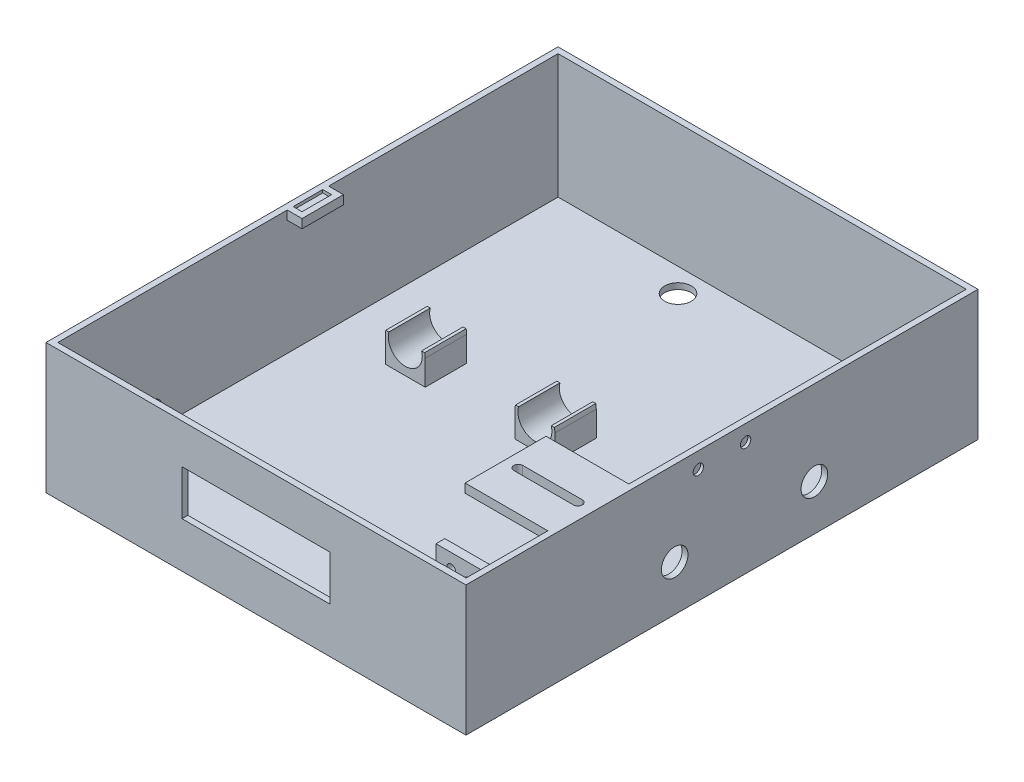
from build123d import *

# Parameters (mm, degrees)
SKETCH_1_W            = 100
SKETCH_1_H            = 100
EXTRUDE_1_DEPTH       = 2
SKETCH_2_W            = 100
SKETCH_2_H            = 20
EXTRUDE_2_DEPTH       = 2
EXTRUDE_3_DEPTH       = 30
EXTRUDE_3_DEPTH_BACK  = 2
SKETCH_3_W            = 100
SKETCH_3_H            = 2
EXTRUDE_4_DEPTH       = 2
SKETCH_5_R            = 3
CUT_EXTRUDE_1_DEPTH   = 2
SKETCH_6_W            = 98
SKETCH_6_H            = 30
CUT_EXTRUDE_2_DEPTH   = 2
SKETCH_8_W            = 2
SKETCH_8_H            = 30
EXTRUDE_6_DEPTH       = 8
EXTRUDE_7_DEPTH       = 3
SKETCH_11_R           = 4.2
SKETCH_11_W           = 8.4
SKETCH_11_H           = 8.211231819
EXTRUDE_8_DEPTH       = 3
SKETCH_12_R           = 3.2
CUT_EXTRUDE_3_DEPTH   = 3
SKETCH_13_W           = 9.4193895
SKETCH_13_H           = 3.297349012
CUT_EXTRUDE_4_DEPTH   = 3
EXTRUDE_9_DEPTH       = 3
SKETCH_16_R           = 3.2
CUT_EXTRUDE_5_DEPTH   = 3
SKETCH_17_W           = 19.245465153
SKETCH_17_H           = 3.637942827
CUT_EXTRUDE_6_DEPTH   = 3
EXTRUDE_10_DEPTH      = 2
SKETCH_19_W           = 2
SKETCH_19_H           = 30
EXTRUDE_11_DEPTH      = 30
SKETCH_20_W           = 32.581201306
SKETCH_20_H           = 34.36919406
CUT_EXTRUDE_7_DEPTH   = 15
EXTRUDE_12_DEPTH      = 1
EXTRUDE_12_DEPTH_BACK = 1
SKETCH_24_R           = 6
CUT_EXTRUDE_8_DEPTH   = 2
SKETCH_25_W           = 15.292350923
SKETCH_25_H           = 4.933016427
CUT_EXTRUDE_9_DEPTH   = 2
SKETCH_26_W           = 132
SKETCH_26_H           = 30
EXTRUDE_14_DEPTH      = 2
SKETCH_27_R           = 7
CUT_EXTRUDE_10_DEPTH  = 2
SKETCH_28_R           = 4.5
CUT_EXTRUDE_11_DEPTH  = 2
SKETCH_29_W           = 132
SKETCH_29_H           = 2
EXTRUDE_15_DEPTH      = 30
SKETCH_30_W           = 2
SKETCH_30_H           = 156
EXTRUDE_16_DEPTH      = 30
SKETCH_31_W           = 6
SKETCH_31_H           = 2
EXTRUDE_17_DEPTH      = 12
SKETCH_34_W           = 6
SKETCH_34_H           = 2
EXTRUDE_18_DEPTH      = 18
SKETCH_36_W           = 2
SKETCH_36_H           = 10
EXTRUDE_19_DEPTH      = 29
SKETCH_37_W           = 1
SKETCH_37_H           = 3
SKETCH_37_W_2         = 2
SKETCH_37_W_3         = 0.567275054
CUT_EXTRUDE_14_DEPTH  = 34.9
SKETCH_38_R           = 1.49999697
SKETCH_38_R_2         = 1.499997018
CUT_EXTRUDE_15_DEPTH  = 34.9
SKETCH_39_R           = 4
CUT_EXTRUDE_16_DEPTH  = 34.9
SKETCH_40_R           = 4
CUT_EXTRUDE_17_DEPTH  = 34.9
SKETCH_41_W           = 134
SKETCH_41_H           = 160
SKETCH_41_W_2         = 130
SKETCH_41_H_2         = 156
EXTRUDE_20_DEPTH      = 12
SKETCH_43_R           = 4.495580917
CUT_EXTRUDE_18_DEPTH  = 34
SKETCH_45_W           = 24.581771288
SKETCH_45_H           = 10.504104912
CUT_EXTRUDE_19_DEPTH  = 13
EXTRUDE_22_DEPTH      = 14
SKETCH_48_W           = 20.164931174
SKETCH_48_H           = 6.07377452
CUT_EXTRUDE_20_DEPTH  = 14
SKETCH_49_W           = 55.263851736
SKETCH_49_H           = 8.07806894
CUT_EXTRUDE_21_DEPTH  = 14
SKETCH_51_W           = 134
SKETCH_51_H           = 13
CUT_EXTRUDE_22_DEPTH  = 46
EXTRUDE_23_DEPTH      = 42
EXTRUDE_23_DEPTH_BACK = 2
SKETCH_52_W           = 133.918309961
SKETCH_52_H           = 1.145194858
SKETCH_53_W           = 130
SKETCH_53_H           = 0.85
EXTRUDE_24_DEPTH      = 42
SKETCH_54_W           = 134
SKETCH_54_H           = 25
EXTRUDE_25_DEPTH      = 44
SKETCH_55_W           = 130
SKETCH_55_H           = 23
CUT_EXTRUDE_23_DEPTH  = 42
EXTRUDE_START         = -2
SKETCH_56_R           = 3
EXTRUDE_26_DEPTH      = 2
SKETCH_57_R           = 3
CUT_EXTRUDE_24_DEPTH  = 2
SKETCH_59_W           = 130
SKETCH_59_H           = 2
CUT_EXTRUDE_25_DEPTH  = 42
EXTRUDE_27_DEPTH      = 42
EXTRUDE_27_DEPTH_BACK = 2
SKETCH_61_W           = 0.081690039
SKETCH_61_H           = 1.145194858
EXTRUDE_28_DEPTH      = 42
EXTRUDE_28_DEPTH_BACK = 2
SKETCH_62_W           = 8
SKETCH_62_H           = 173.145194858
SKETCH_63_W           = 8
SKETCH_63_H           = 169.086885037
CUT_EXTRUDE_26_DEPTH  = 42
SKETCH_64_R           = 4.5
CUT_EXTRUDE_27_DEPTH  = 42
SKETCH_65_W           = 30.136526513
SKETCH_65_H           = 27
SKETCH_65_R           = 10
SKETCH_65_R_2         = 1.499926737
SKETCH_65_R_3         = 1.5
EXTRUDE_29_DEPTH      = 3
SKETCH_66_W           = 43.808608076
SKETCH_66_H           = 12.287780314
CUT_EXTRUDE_28_DEPTH  = 40
SKETCH_68_W           = 27.379130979
SKETCH_68_H           = 3
EXTRUDE_30_DEPTH      = 28
CUT_EXTRUDE_29_DEPTH  = 28
CUT_EXTRUDE_30_DEPTH  = 28
EXTRUDE_32_DEPTH      = 3
SKETCH_73_W           = 3
SKETCH_73_H           = 10
CUT_EXTRUDE_32_DEPTH  = 1
SKETCH_74_R           = 1.75
CUT_EXTRUDE_33_DEPTH  = 1
SKETCH_75_R           = 4.5
CUT_EXTRUDE_34_DEPTH  = 10


with BuildPart() as part:
    # Sketch 1 → Extrude 1 (new body)
    with BuildSketch(Plane(origin=(0, 0, 0), x_dir=(1, 0, 0), z_dir=(0, 1, 0))):
        with Locations((50, 50)):
            Rectangle(SKETCH_1_W, SKETCH_1_H)
    extrude(amount=EXTRUDE_1_DEPTH)

    # Sketch 2 → Extrude 2 (add)
    with BuildSketch(Plane(origin=(0, 2, 0), x_dir=(1, 0, 0), z_dir=(0, 1, 0))):
        with Locations((50, -10)):
            Rectangle(SKETCH_2_W, SKETCH_2_H)
    extrude(amount=-EXTRUDE_2_DEPTH)

    # Sketch 3 → Extrude 3 (add, two sides: drawn at the far end of the back side and taken through both)
    with BuildSketch(Plane(origin=(0, 2, 0), x_dir=(1, 0, 0), z_dir=(0, 1, 0)).offset(-EXTRUDE_3_DEPTH_BACK)):
        with Locations((50, -21)):
            Rectangle(SKETCH_3_W, SKETCH_3_H)
    extrude(amount=EXTRUDE_3_DEPTH + EXTRUDE_3_DEPTH_BACK)

    # Sketch 4 → Extrude 4 (add)
    with BuildSketch(Plane.ZY):
        Polygon((20, 2), (-100, 2), (-100, 25.5), (-100, 32), (20, 32), (20, 25.5), align=None)
    extrude(amount=-EXTRUDE_4_DEPTH)

    # Sketch 5 → Cut-Extrude 1 (cut)
    with BuildSketch(Plane(origin=(2, 0, 0), x_dir=(0, 0, -1), z_dir=(1, 0, 0))):
        with Locations((-11.76108555, 10.625735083)):
            Circle(SKETCH_5_R)
    extrude(amount=-CUT_EXTRUDE_1_DEPTH, mode=Mode.SUBTRACT)

    # Sketch 6 → Cut-Extrude 2 (cut)
    with BuildSketch(Plane(origin=(0, 0, 20), x_dir=(-1, 0, 0), z_dir=(0, 0, -1))):
        with Locations((-51, 17)):
            Rectangle(SKETCH_6_W, SKETCH_6_H)
    extrude(amount=-CUT_EXTRUDE_2_DEPTH, mode=Mode.SUBTRACT)

    # Sketch 8 → Extrude 6 (add)
    with BuildSketch(Plane.XY.offset(22)):
        with Locations((1, 17)):
            Rectangle(SKETCH_8_W, SKETCH_8_H)
        Polygon((2, 2), (0, 2), (0, 0), (100, 0), (100, 2), align=None)
    extrude(amount=EXTRUDE_6_DEPTH)

    # Sketch 9 → Extrude 7 (add)
    with BuildSketch(Plane(origin=(62.039830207, 6.22209503, 11), x_dir=(-1, 0, 0), z_dir=(0, 0, -1))):
        with BuildLine():
            Line((36.42454022, -4.22209503), (36.42454022, 3.989136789))
            ThreePointArc((36.42454022, 3.989136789), (33.22454022, 0.789136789), (30.02454022, 3.989136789))
            Line((30.02454022, 3.989136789), (30.02454022, -4.22209503))
            Line((30.02454022, -4.22209503), (36.42454022, -4.22209503))
        make_face()
        with BuildLine():
            ThreePointArc((30.02454022, 3.989136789), (33.22454022, 0.789136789), (36.42454022, 3.989136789))
            Line((36.42454022, 3.989136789), (30.02454022, 3.989136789))
        make_face()
        with BuildLine():
            Line((30.02454022, 3.989136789), (36.42454022, 3.989136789))
            ThreePointArc((36.42454022, 3.989136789), (33.22454022, 7.189136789), (30.02454022, 3.989136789))
        make_face()
        with BuildLine():
            ThreePointArc((30.02454022, 3.989136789), (33.22454022, 0.789136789), (36.42454022, 3.989136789))
            Line((36.42454022, 3.989136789), (30.02454022, 3.989136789))
        make_face()
        with BuildLine():
            Line((30.02454022, 3.989136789), (36.42454022, 3.989136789))
            ThreePointArc((36.42454022, 3.989136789), (33.22454022, 7.189136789), (30.02454022, 3.989136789))
        make_face()
    extrude(amount=EXTRUDE_7_DEPTH)

    # Sketch 11 → Extrude 8 (add)
    with BuildSketch(Plane(origin=(0, 0, 8), x_dir=(-1, 0, 0), z_dir=(0, 0, -1))):
        with Locations((-28.815289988, 10.211231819)):
            Circle(SKETCH_11_R)
        with Locations((-28.815289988, 6.105615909)):
            Rectangle(SKETCH_11_W, SKETCH_11_H)
    extrude(amount=-EXTRUDE_8_DEPTH)

    # Sketch 12 → Cut-Extrude 3 (cut)
    with BuildSketch(Plane(origin=(0, 0, 8), x_dir=(-1, 0, 0), z_dir=(0, 0, -1))):
        with Locations((-28.833630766, 10.211391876)):
            Circle(SKETCH_12_R)
    extrude(amount=-CUT_EXTRUDE_3_DEPTH, mode=Mode.SUBTRACT)

    # Sketch 13 → Cut-Extrude 4 (cut)
    with BuildSketch(Plane(origin=(0, 0, 8), x_dir=(-1, 0, 0), z_dir=(0, 0, -1))):
        with Locations((-28.762158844, 13.278437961)):
            Rectangle(SKETCH_13_W, SKETCH_13_H)
    extrude(amount=-CUT_EXTRUDE_4_DEPTH, mode=Mode.SUBTRACT)

    # Sketch 15 → Extrude 9 (add)
    with BuildSketch(Plane(origin=(41.4, 0, 0), x_dir=(0, 0, -1), z_dir=(1, 0, 0))):
        with BuildLine():
            ThreePointArc((-18.624783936, 10.211391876), (-22.824783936, 14.411391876), (-27.024783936, 10.211391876))
            Line((-27.024783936, 10.211391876), (-18.624783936, 10.211391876))
        make_face()
        with BuildLine():
            Line((-18.624783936, 10.211391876), (-27.024783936, 10.211391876))
            ThreePointArc((-27.024783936, 10.211391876), (-22.824783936, 6.011391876), (-18.624783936, 10.211391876))
        make_face()
        with BuildLine():
            ThreePointArc((-18.624783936, 10.211391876), (-22.824783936, 14.411391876), (-27.024783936, 10.211391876))
            Line((-27.024783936, 10.211391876), (-18.624783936, 10.211391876))
        make_face()
        with BuildLine():
            Line((-18.624783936, 10.211391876), (-27.024783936, 10.211391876))
            ThreePointArc((-27.024783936, 10.211391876), (-22.824783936, 6.011391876), (-18.624783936, 10.211391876))
        make_face()
        with BuildLine():
            ThreePointArc((-18.624783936, 10.211391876), (-22.824783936, 6.011391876), (-27.024783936, 10.211391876))
            Line((-27.024783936, 10.211391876), (-27.024783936, 2))
            Line((-27.024783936, 2), (-18.624783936, 2))
            Line((-18.624783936, 2), (-18.624783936, 10.211391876))
        make_face()
    extrude(amount=EXTRUDE_9_DEPTH)

    # Sketch 16 → Cut-Extrude 5 (cut)
    with BuildSketch(Plane(origin=(44.4, 0, 0), x_dir=(0, 0, -1), z_dir=(1, 0, 0))):
        with Locations((-22.824783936, 10.211391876)):
            Circle(SKETCH_16_R)
    extrude(amount=-CUT_EXTRUDE_5_DEPTH, mode=Mode.SUBTRACT)

    # Sketch 17 → Cut-Extrude 6 (cut)
    with BuildSketch(Plane(origin=(44.4, 0, 0), x_dir=(0, 0, -1), z_dir=(1, 0, 0))):
        with Locations((-20.622732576, 13.448734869)):
            Rectangle(SKETCH_17_W, SKETCH_17_H)
    extrude(amount=-CUT_EXTRUDE_6_DEPTH, mode=Mode.SUBTRACT)

    # Sketch 18 → Extrude 10 (add)
    with BuildSketch(Plane(origin=(0, 2, 0), x_dir=(1, 0, 0), z_dir=(0, 1, 0))):
        Polygon((134, 100), (100, 100), (100, -30), (100, -60), (134, -60), align=None)
        Polygon((100, -60), (100, -30), (2, -30), (0, -30), (0, -60), align=None)
    extrude(amount=-EXTRUDE_10_DEPTH)

    # Sketch 19 → Extrude 11 (add)
    with BuildSketch(Plane(origin=(0, 2, 0), x_dir=(1, 0, 0), z_dir=(0, 1, 0))):
        with Locations((1, -45)):
            Rectangle(SKETCH_19_W, SKETCH_19_H)
    extrude(amount=EXTRUDE_11_DEPTH)

    # Sketch 20 → Cut-Extrude 7 (cut)
    with BuildSketch(Plane(origin=(0, 2, 0), x_dir=(1, 0, 0), z_dir=(0, 1, 0))):
        with Locations((34.606556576, -17.953210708)):
            Rectangle(SKETCH_20_W, SKETCH_20_H)
    extrude(amount=CUT_EXTRUDE_7_DEPTH, mode=Mode.SUBTRACT)

    # Sketch 23 → Extrude 12 (add, two sides: drawn at the far end of the back side and taken through both)
    with BuildSketch(Plane.XY.offset(28).offset(-EXTRUDE_12_DEPTH_BACK)):
        with BuildLine():
            ThreePointArc((35.916247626, 10.390840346), (28.916247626, 17.390840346), (21.916247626, 10.390840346))
            Line((21.916247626, 10.390840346), (35.916247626, 10.390840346))
        make_face()
        with BuildLine():
            Line((35.916247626, 10.390840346), (21.916247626, 10.390840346))
            ThreePointArc((21.916247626, 10.390840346), (28.916247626, 3.390840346), (35.916247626, 10.390840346))
        make_face()
        with BuildLine():
            ThreePointArc((35.916247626, 10.390840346), (28.916247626, 17.390840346), (21.916247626, 10.390840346))
            Line((21.916247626, 10.390840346), (35.916247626, 10.390840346))
        make_face()
        with BuildLine():
            Line((35.916247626, 10.390840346), (21.916247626, 10.390840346))
            ThreePointArc((21.916247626, 10.390840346), (28.916247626, 3.390840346), (35.916247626, 10.390840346))
        make_face()
        with BuildLine():
            ThreePointArc((35.916247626, 10.390840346), (28.916247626, 3.390840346), (21.916247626, 10.390840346))
            Line((21.916247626, 10.390840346), (21.916247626, 2))
            Line((21.916247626, 2), (35.916247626, 2))
            Line((35.916247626, 2), (35.916247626, 10.390840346))
        make_face()
    extrude(amount=EXTRUDE_12_DEPTH + EXTRUDE_12_DEPTH_BACK)

    # Sketch 24 → Cut-Extrude 8 (cut)
    with BuildSketch(Plane.XY.offset(29)):
        with Locations((28.916247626, 10.390840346)):
            Circle(SKETCH_24_R)
    extrude(amount=-CUT_EXTRUDE_8_DEPTH, mode=Mode.SUBTRACT)

    # Sketch 25 → Cut-Extrude 9 (cut)
    with BuildSketch(Plane.XY.offset(29)):
        with Locations((27.925151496, 15.50283146)):
            Rectangle(SKETCH_25_W, SKETCH_25_H)
    extrude(amount=-CUT_EXTRUDE_9_DEPTH, mode=Mode.SUBTRACT)

    # Sketch 26 → Extrude 14 (add)
    with BuildSketch(Plane(origin=(0, 0, -100), x_dir=(-1, 0, 0), z_dir=(0, 0, -1))):
        with Locations((-68, 17)):
            Rectangle(SKETCH_26_W, SKETCH_26_H)
    extrude(amount=-EXTRUDE_14_DEPTH)

    # Sketch 27 → Cut-Extrude 10 (cut)
    with BuildSketch(Plane(origin=(0, 0, -100), x_dir=(-1, 0, 0), z_dir=(0, 0, -1))):
        with Locations((-118.35155475, 10.5)):
            Circle(SKETCH_27_R)
    extrude(amount=-CUT_EXTRUDE_10_DEPTH, mode=Mode.SUBTRACT)

    # Sketch 28 → Cut-Extrude 11 (cut)
    with BuildSketch(Plane(origin=(0, 0, -100), x_dir=(-1, 0, 0), z_dir=(0, 0, -1))):
        with Locations((-28.760853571, 10.5)):
            Circle(SKETCH_28_R)
        with Locations((-72.0172074, 10.5)):
            Circle(SKETCH_28_R)
    extrude(amount=-CUT_EXTRUDE_11_DEPTH, mode=Mode.SUBTRACT)

    # Sketch 29 → Extrude 15 (add)
    with BuildSketch(Plane(origin=(0, 2, 0), x_dir=(1, 0, 0), z_dir=(0, 1, 0))):
        with Locations((68, -59)):
            Rectangle(SKETCH_29_W, SKETCH_29_H)
    extrude(amount=EXTRUDE_15_DEPTH)

    # Sketch 30 → Extrude 16 (add)
    with BuildSketch(Plane(origin=(0, 2, 0), x_dir=(1, 0, 0), z_dir=(0, 1, 0))):
        with Locations((133, 20)):
            Rectangle(SKETCH_30_W, SKETCH_30_H)
    extrude(amount=EXTRUDE_16_DEPTH)

    # Sketch 31 → Extrude 17 (add)
    with BuildSketch(Plane(origin=(0, 2, 0), x_dir=(1, 0, 0), z_dir=(0, 1, 0))):
        with Locations((100.184346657, -0.463561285)):
            Rectangle(SKETCH_31_W, SKETCH_31_H)
    extrude(amount=EXTRUDE_17_DEPTH)

    # Sketch 34 → Extrude 18 (add)
    with BuildSketch(Plane(origin=(0, 14, 0), x_dir=(1, 0, 0), z_dir=(0, 1, 0))):
        with Locations((100.184346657, -0.463561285)):
            Rectangle(SKETCH_34_W, SKETCH_34_H)
    extrude(amount=EXTRUDE_18_DEPTH)

    # Sketch 36 → Extrude 19 (add)
    with BuildSketch(Plane.ZY.offset(-132)):
        with Locations((0.458853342, 27)):
            Rectangle(SKETCH_36_W, SKETCH_36_H)
    extrude(amount=EXTRUDE_19_DEPTH)

    # Sketch 37 → Cut-Extrude 14 (cut)
    with BuildSketch(Plane.ZY.offset(-97.184346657)):
        with Locations((1.963561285, 30.5)):
            Rectangle(SKETCH_37_W, SKETCH_37_H)
        with Locations((0.463561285, 30.5)):
            Rectangle(SKETCH_37_W_2, SKETCH_37_H)
        with Locations((-0.820076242, 30.5)):
            Rectangle(SKETCH_37_W_3, SKETCH_37_H)
    extrude(amount=-CUT_EXTRUDE_14_DEPTH, mode=Mode.SUBTRACT)

    # Sketch 38 → Cut-Extrude 15 (cut)
    with BuildSketch(Plane.XY.offset(1.458853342)):
        with Locations((118.155088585, 23.67908064)):
            Circle(SKETCH_38_R)
        with Locations((99.770344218, 5.294336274)):
            Circle(SKETCH_38_R_2)
    extrude(amount=-CUT_EXTRUDE_15_DEPTH, mode=Mode.SUBTRACT)

    # Sketch 39 → Cut-Extrude 16 (cut)
    with BuildSketch(Plane.ZY.offset(-132)):
        with Locations((46.081039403, 14.338211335)):
            Circle(SKETCH_39_R)
    extrude(amount=-CUT_EXTRUDE_16_DEPTH, mode=Mode.SUBTRACT)

    # Sketch 40 → Cut-Extrude 17 (cut)
    with BuildSketch(Plane.ZY.offset(-132)):
        with Locations((-24.85411352, 24.843091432)):
            Circle(SKETCH_40_R)
        with Locations((-24.85411352, 14.309929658)):
            Circle(SKETCH_40_R)
    extrude(amount=-CUT_EXTRUDE_17_DEPTH, mode=Mode.SUBTRACT)

    # Sketch 41 → Extrude 20 (add)
    with BuildSketch(Plane(origin=(0, 32, 0), x_dir=(1, 0, 0), z_dir=(0, 1, 0))):
        with Locations((67, 20)):
            Rectangle(SKETCH_41_W, SKETCH_41_H)
        with Locations((67, 20)):
            Rectangle(SKETCH_41_W_2, SKETCH_41_H_2, mode=Mode.SUBTRACT)
    extrude(amount=EXTRUDE_20_DEPTH)

    # Sketch 43 → Cut-Extrude 18 (cut)
    with BuildSketch(Plane.XZ):
        with Locations(Location((50.533235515, -78.174550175, 0), (0, 0, 270))):
            Circle(SKETCH_43_R)
    extrude(amount=-CUT_EXTRUDE_18_DEPTH, mode=Mode.SUBTRACT)

    # Sketch 45 → Cut-Extrude 19 (cut)
    with BuildSketch(Plane(origin=(0, 2, 0), x_dir=(1, 0, 0), z_dir=(0, 1, 0))):
        with Locations((29.338045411, -28.201648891)):
            Rectangle(SKETCH_45_W, SKETCH_45_H)
    extrude(amount=CUT_EXTRUDE_19_DEPTH, mode=Mode.SUBTRACT)

    # Sketch 47 → Extrude 22 (add)
    with BuildSketch(Plane(origin=(0, 0, -22), x_dir=(-1, 0, 0), z_dir=(0, 0, -1))):
        with BuildLine():
            Line((-65.566783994, 2), (-65.566783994, 10.5))
            ThreePointArc((-65.566783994, 10.5), (-72.316783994, 3.75), (-79.066783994, 10.5))
            Line((-79.066783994, 10.5), (-79.066783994, 2))
            Line((-79.066783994, 2), (-65.566783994, 2))
        make_face()
        with BuildLine():
            ThreePointArc((-78.066783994, 10.5), (-72.316783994, 16.25), (-66.566783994, 10.5))
            Line((-66.566783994, 10.5), (-65.566783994, 10.5))
            ThreePointArc((-65.566783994, 10.5), (-72.316783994, 17.25), (-79.066783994, 10.5))
            Line((-79.066783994, 10.5), (-78.066783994, 10.5))
        make_face()
        with BuildLine():
            Line((-65.566783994, 10.5), (-66.566783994, 10.5))
            ThreePointArc((-66.566783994, 10.5), (-72.316783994, 4.75), (-78.066783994, 10.5))
            Line((-78.066783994, 10.5), (-79.066783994, 10.5))
            ThreePointArc((-79.066783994, 10.5), (-72.316783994, 3.75), (-65.566783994, 10.5))
        make_face()
        with BuildLine():
            ThreePointArc((-78.066783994, 10.5), (-72.316783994, 16.25), (-66.566783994, 10.5))
            Line((-66.566783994, 10.5), (-65.566783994, 10.5))
            ThreePointArc((-65.566783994, 10.5), (-72.316783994, 17.25), (-79.066783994, 10.5))
            Line((-79.066783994, 10.5), (-78.066783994, 10.5))
        make_face()
        with BuildLine():
            Line((-65.566783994, 10.5), (-66.566783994, 10.5))
            ThreePointArc((-66.566783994, 10.5), (-72.316783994, 4.75), (-78.066783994, 10.5))
            Line((-78.066783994, 10.5), (-79.066783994, 10.5))
            ThreePointArc((-79.066783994, 10.5), (-72.316783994, 3.75), (-65.566783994, 10.5))
        make_face()
    extrude_22 = extrude(amount=-EXTRUDE_22_DEPTH)

    # Sketch 48 → Cut-Extrude 20 (cut)
    with BuildSketch(Plane(origin=(0, 0, -22), x_dir=(-1, 0, 0), z_dir=(0, 0, -1))):
        with Locations((-72.496246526, 15.097371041)):
            Rectangle(SKETCH_48_W, SKETCH_48_H)
    extrude(amount=-CUT_EXTRUDE_20_DEPTH, mode=Mode.SUBTRACT)

    # Mirror 2: Extrude 22 across plane
    add(extrude_22.mirror(Plane(origin=(50.4, 0, 0), x_dir=(0, 0, 1), z_dir=(1, 0, 0))))

    # Sketch 49 → Cut-Extrude 21 (cut)
    with BuildSketch(Plane.XY.offset(-8)):
        with Locations((38.117713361, 16.099518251)):
            Rectangle(SKETCH_49_W, SKETCH_49_H)
    extrude(amount=-CUT_EXTRUDE_21_DEPTH, mode=Mode.SUBTRACT)

    # Sketch 51 → Cut-Extrude 22 (cut)
    with BuildSketch(Plane(origin=(0, 44, 0), x_dir=(1, 0, 0), z_dir=(0, 1, 0))):
        with Locations((67, 93.5)):
            Rectangle(SKETCH_51_W, SKETCH_51_H)
    extrude(amount=-CUT_EXTRUDE_22_DEPTH, mode=Mode.SUBTRACT)

    # Sketch 52 → Extrude 23 (add, two sides: drawn at the far end of the back side and taken through both)
    with BuildSketch(Plane(origin=(0, 2, 0), x_dir=(1, 0, 0), z_dir=(0, 1, 0)).offset(-EXTRUDE_23_DEPTH_BACK)):
        with Locations((66.959154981, 87.572597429)):
            Rectangle(SKETCH_52_W, SKETCH_52_H)
    extrude(amount=EXTRUDE_23_DEPTH + EXTRUDE_23_DEPTH_BACK)

    # Sketch 53 → Extrude 24 (add)
    with BuildSketch(Plane(origin=(0, 44, 0), x_dir=(1, 0, 0), z_dir=(0, 1, 0))):
        with Locations((67, 86.575)):
            Rectangle(SKETCH_53_W, SKETCH_53_H)
    extrude(amount=-EXTRUDE_24_DEPTH)

    # Sketch 54 → Extrude 25 (add)
    with BuildSketch(Plane(origin=(0, 44, 0), x_dir=(1, 0, 0), z_dir=(0, 1, 0))):
        with Locations((67, -72.5)):
            Rectangle(SKETCH_54_W, SKETCH_54_H)
    extrude(amount=-EXTRUDE_25_DEPTH)

    # Sketch 55 → Cut-Extrude 23 (cut)
    with BuildSketch(Plane(origin=(0, 44, 0), x_dir=(1, 0, 0), z_dir=(0, 1, 0))):
        with Locations((67, -69.5)):
            Rectangle(SKETCH_55_W, SKETCH_55_H)
    extrude(amount=-CUT_EXTRUDE_23_DEPTH, mode=Mode.SUBTRACT)

    # Sketch 56 → Extrude 26 (add)
    with BuildSketch(Plane.ZY.offset(EXTRUDE_START)):
        with Locations((11.76108555, 10.625735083)):
            Circle(SKETCH_56_R)
    extrude(amount=EXTRUDE_26_DEPTH)

    # Sketch 57 → Cut-Extrude 24 (cut)
    with BuildSketch(Plane.ZY):
        with Locations((50.831259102, 8)):
            Circle(SKETCH_57_R)
    extrude(amount=-CUT_EXTRUDE_24_DEPTH, mode=Mode.SUBTRACT)

    # Sketch 59 → Cut-Extrude 25 (cut)
    with BuildSketch(Plane(origin=(0, 2, 0), x_dir=(1, 0, 0), z_dir=(0, 1, 0))):
        with Locations((67, -82)):
            Rectangle(SKETCH_59_W, SKETCH_59_H)
    extrude(amount=CUT_EXTRUDE_25_DEPTH, mode=Mode.SUBTRACT)

    # Sketch 61 → Extrude 27 (add, two sides: drawn at the far end of the back side and taken through both)
    with BuildSketch(Plane(origin=(0, 2, 0), x_dir=(1, 0, 0), z_dir=(0, 1, 0)).offset(-EXTRUDE_27_DEPTH_BACK)):
        with Locations((133.95915498, 87.572597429)):
            Rectangle(SKETCH_61_W, SKETCH_61_H)
    extrude(amount=EXTRUDE_27_DEPTH + EXTRUDE_27_DEPTH_BACK)

    # Sketch 62 → Extrude 28 (add, two sides: drawn at the far end of the back side and taken through both)
    with BuildSketch(Plane(origin=(0, 2, 0), x_dir=(1, 0, 0), z_dir=(0, 1, 0)).offset(-EXTRUDE_28_DEPTH_BACK)):
        with Locations((138, 1.572597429)):
            Rectangle(SKETCH_62_W, SKETCH_62_H)
    extrude(amount=EXTRUDE_28_DEPTH + EXTRUDE_28_DEPTH_BACK)

    # Sketch 63 → Cut-Extrude 26 (cut)
    with BuildSketch(Plane(origin=(0, 44, 0), x_dir=(1, 0, 0), z_dir=(0, 1, 0))):
        with Locations((136, 1.606557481)):
            Rectangle(SKETCH_63_W, SKETCH_63_H)
    extrude(amount=-CUT_EXTRUDE_26_DEPTH, mode=Mode.SUBTRACT)

    # Sketch 64 → Cut-Extrude 27 (cut)
    with BuildSketch(Plane(origin=(142, 0, 0), x_dir=(0, 0, -1), z_dir=(1, 0, 0))):
        with Locations((-14.417321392, 15.391452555)):
            Circle(SKETCH_64_R)
    extrude(amount=-CUT_EXTRUDE_27_DEPTH, mode=Mode.SUBTRACT)

    # Sketch 65 → Extrude 29 (add)
    with BuildSketch(Plane(origin=(0, 0, 63), x_dir=(-1, 0, 0), z_dir=(0, 0, -1))):
        with Locations((-124.931736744, 15.5)):
            Rectangle(SKETCH_65_W, SKETCH_65_H)
        with Locations((-124.145377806, 15.265990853)):
            Circle(SKETCH_65_R, mode=Mode.SUBTRACT)
        with Locations((-133.401131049, 5.744197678)):
            Circle(SKETCH_65_R_2, mode=Mode.SUBTRACT)
        with Locations((-115.016386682, 24.127775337)):
            Circle(SKETCH_65_R_3, mode=Mode.SUBTRACT)
    extrude(amount=EXTRUDE_29_DEPTH)

    # Sketch 66 → Cut-Extrude 28 (cut)
    with BuildSketch(Plane(origin=(0, 2, 0), x_dir=(1, 0, 0), z_dir=(0, 1, 0))):
        with Locations((114.919740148, 0.098383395)):
            Rectangle(SKETCH_66_W, SKETCH_66_H)
    extrude(amount=CUT_EXTRUDE_28_DEPTH, mode=Mode.SUBTRACT)

    # Sketch 68 → Extrude 30 (add)
    with BuildSketch(Plane.ZY.offset(-140)):
        with Locations((41.60831424, 42.5)):
            Rectangle(SKETCH_68_W, SKETCH_68_H)
    extrude(amount=EXTRUDE_30_DEPTH)

    # Sketch 69 → Cut-Extrude 29 (cut)
    with BuildSketch(Plane(origin=(0, 44, 0), x_dir=(1, 0, 0), z_dir=(0, 1, 0))):
        with BuildLine():
            Line((136.754489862, -43.400360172), (116.588601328, -43.400360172))
            ThreePointArc((116.588601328, -43.400360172), (115.088601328, -41.900360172), (116.588601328, -40.400360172))
            Line((116.588601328, -40.400360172), (136.754489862, -40.400360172))
            ThreePointArc((136.754489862, -40.400360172), (138.254489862, -41.900360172), (136.754489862, -43.400360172))
        make_face()
    extrude(amount=-CUT_EXTRUDE_29_DEPTH, mode=Mode.SUBTRACT)

    # Sketch 70 → Cut-Extrude 30 (cut)
    with BuildSketch(Plane.XY.offset(85)):
        Polygon((96.038275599, 30.620344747), (45.961724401, 15.379655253), (96.038275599, 15.379655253), align=None)
        Polygon((45.961724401, 30.620344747), (45.961724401, 15.379655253), (96.038275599, 30.620344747), align=None)
    extrude(amount=-CUT_EXTRUDE_30_DEPTH, mode=Mode.SUBTRACT)

    # Sketch 71 → Extrude 32 (add)
    with BuildSketch(Plane(origin=(0, 44, 0), x_dir=(1, 0, 0), z_dir=(0, 1, 0))):
        Polygon((4, -5.425), (0, -5.425), (0, 8.575), (4, 8.575), (7, 8.575), (7, -5.425), align=None)
    extrude(amount=-EXTRUDE_32_DEPTH)

    # Sketch 73 → Cut-Extrude 32 (cut)
    with BuildSketch(Plane(origin=(0, 44, 0), x_dir=(1, 0, 0), z_dir=(0, 1, 0))):
        with Locations((3.5, 1.575)):
            Rectangle(SKETCH_73_W, SKETCH_73_H)
    extrude(amount=-CUT_EXTRUDE_32_DEPTH, mode=Mode.SUBTRACT)

    # Sketch 74 → Cut-Extrude 33 (cut)
    with BuildSketch(Plane(origin=(142, 0, 0), x_dir=(0, 0, -1), z_dir=(1, 0, 0))):
        with Locations((9.572597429, 38.5)):
            Circle(SKETCH_74_R)
        with Locations((-6.427402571, 38.5)):
            Circle(SKETCH_74_R)
    extrude(amount=-CUT_EXTRUDE_33_DEPTH, mode=Mode.SUBTRACT)

    # Sketch 75 → Cut-Extrude 34 (cut)
    with BuildSketch(Plane(origin=(142, 0, 0), x_dir=(0, 0, -1), z_dir=(1, 0, 0))):
        with Locations((32.813994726, 15.391452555)):
            Circle(SKETCH_75_R)
    extrude(amount=-CUT_EXTRUDE_34_DEPTH, mode=Mode.SUBTRACT)


solid = part.part
